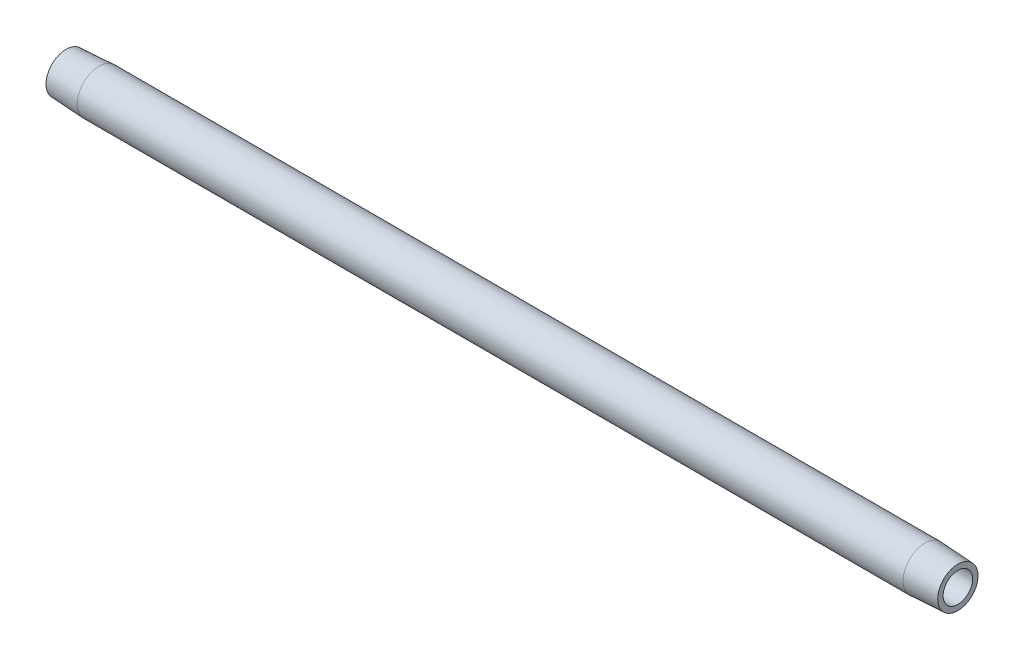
ISO-10303-21;
HEADER;
FILE_DESCRIPTION(('STEP AP214'),'2;1');
FILE_NAME('part.step','',(''),(''),'','','');
FILE_SCHEMA(('AUTOMOTIVE_DESIGN { 1 0 10303 214 1 1 1 1 }'));
ENDSEC;
DATA;
#1=APPLICATION_CONTEXT('core data for automotive mechanical design processes');
#2=APPLICATION_PROTOCOL_DEFINITION('international standard','automotive_design',2000,#1);
#3=PRODUCT_CONTEXT('',#1,'mechanical');
#4=PRODUCT('Part','Part','',(#3));
#5=PRODUCT_RELATED_PRODUCT_CATEGORY('part','',(#4));
#6=PRODUCT_DEFINITION_FORMATION('','',#4);
#7=PRODUCT_DEFINITION_CONTEXT('part definition',#1,'design');
#8=PRODUCT_DEFINITION('design','',#6,#7);
#9=PRODUCT_DEFINITION_SHAPE('','',#8);
#10=(LENGTH_UNIT() NAMED_UNIT(*) SI_UNIT(.MILLI.,.METRE.));
#11=(NAMED_UNIT(*) PLANE_ANGLE_UNIT() SI_UNIT($,.RADIAN.));
#12=(NAMED_UNIT(*) SI_UNIT($,.STERADIAN.) SOLID_ANGLE_UNIT());
#13=UNCERTAINTY_MEASURE_WITH_UNIT(LENGTH_MEASURE(1.E-05),#10,'distance_accuracy_value','');
#14=(GEOMETRIC_REPRESENTATION_CONTEXT(3) GLOBAL_UNCERTAINTY_ASSIGNED_CONTEXT((#13)) GLOBAL_UNIT_ASSIGNED_CONTEXT((#10,
#11,#12)) REPRESENTATION_CONTEXT('',''));
#15=CARTESIAN_POINT('',(0.,0.,0.));
#16=DIRECTION('',(0.,0.,1.));
#17=DIRECTION('',(1.,0.,0.));
#18=AXIS2_PLACEMENT_3D('',#15,#16,#17);
#19=CARTESIAN_POINT('',(279.4,0.,-4.62277681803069));
#20=DIRECTION('',(-1.,0.,0.));
#21=DIRECTION('',(0.,0.,1.));
#22=AXIS2_PLACEMENT_3D('',#19,#20,#21);
#23=PLANE('',#22);
#24=CARTESIAN_POINT('',(279.4,0.,0.));
#25=DIRECTION('',(-1.,0.,0.));
#26=DIRECTION('',(0.,0.,1.));
#27=AXIS2_PLACEMENT_3D('',#24,#25,#26);
#28=CIRCLE('',#27,6.31752683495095);
#29=CARTESIAN_POINT('',(279.4,0.,6.31752683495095));
#30=VERTEX_POINT('',#29);
#31=EDGE_CURVE('E10',#30,#30,#28,.T.);
#32=ORIENTED_EDGE('',*,*,#31,.F.);
#33=EDGE_LOOP('',(#32));
#34=FACE_BOUND('',#33,.T.);
#35=CARTESIAN_POINT('',(279.4,0.,0.));
#36=DIRECTION('',(-1.,0.,0.));
#37=DIRECTION('',(0.,0.,1.));
#38=AXIS2_PLACEMENT_3D('',#35,#36,#37);
#39=CIRCLE('',#38,4.62277681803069);
#40=CARTESIAN_POINT('',(279.4,0.,4.62277681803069));
#41=VERTEX_POINT('',#40);
#42=EDGE_CURVE('E52',#41,#41,#39,.T.);
#43=ORIENTED_EDGE('',*,*,#42,.T.);
#44=EDGE_LOOP('',(#43));
#45=FACE_BOUND('',#44,.T.);
#46=ADVANCED_FACE('F30',(#34,#45),#23,.F.);
#47=CARTESIAN_POINT('',(279.4,0.,0.));
#48=DIRECTION('',(-1.,0.,0.));
#49=DIRECTION('',(0.,0.,1.));
#50=AXIS2_PLACEMENT_3D('',#47,#48,#49);
#51=CONICAL_SURFACE('',#50,6.31752683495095,0.052359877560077);
#52=CARTESIAN_POINT('',(269.087600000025,0.,0.));
#53=DIRECTION('',(-1.,0.,0.));
#54=DIRECTION('',(0.,0.,1.));
#55=AXIS2_PLACEMENT_3D('',#52,#53,#54);
#56=CIRCLE('',#55,6.85797681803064);
#57=CARTESIAN_POINT('',(269.087600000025,0.,6.85797681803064));
#58=VERTEX_POINT('',#57);
#59=EDGE_CURVE('E36',#58,#58,#56,.T.);
#60=ORIENTED_EDGE('',*,*,#59,.F.);
#61=EDGE_LOOP('',(#60));
#62=FACE_BOUND('',#61,.T.);
#63=ORIENTED_EDGE('',*,*,#31,.T.);
#64=EDGE_LOOP('',(#63));
#65=FACE_BOUND('',#64,.T.);
#66=ADVANCED_FACE('F77',(#62,#65),#51,.T.);
#67=CARTESIAN_POINT('',(-6.37599469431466,0.,0.));
#68=DIRECTION('',(-1.,0.,0.));
#69=DIRECTION('',(0.,0.,1.));
#70=AXIS2_PLACEMENT_3D('',#67,#68,#69);
#71=CYLINDRICAL_SURFACE('',#70,6.85797681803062);
#72=CARTESIAN_POINT('',(10.3123999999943,0.,0.));
#73=DIRECTION('',(-1.,0.,0.));
#74=DIRECTION('',(0.,0.,1.));
#75=AXIS2_PLACEMENT_3D('',#72,#73,#74);
#76=CIRCLE('',#75,6.8579768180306);
#77=CARTESIAN_POINT('',(10.3123999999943,0.,6.8579768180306));
#78=VERTEX_POINT('',#77);
#79=EDGE_CURVE('E40',#78,#78,#76,.T.);
#80=ORIENTED_EDGE('',*,*,#79,.F.);
#81=EDGE_LOOP('',(#80));
#82=FACE_BOUND('',#81,.T.);
#83=ORIENTED_EDGE('',*,*,#59,.T.);
#84=EDGE_LOOP('',(#83));
#85=FACE_BOUND('',#84,.T.);
#86=ADVANCED_FACE('F72',(#82,#85),#71,.T.);
#87=CARTESIAN_POINT('',(10.3123999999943,0.,0.));
#88=DIRECTION('',(1.,0.,0.));
#89=DIRECTION('',(0.,0.,-1.));
#90=AXIS2_PLACEMENT_3D('',#87,#88,#89);
#91=CONICAL_SURFACE('',#90,6.8579768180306,0.0523598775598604);
#92=CARTESIAN_POINT('',(1.90819582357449E-11,0.,0.));
#93=DIRECTION('',(-1.,0.,0.));
#94=DIRECTION('',(0.,0.,1.));
#95=AXIS2_PLACEMENT_3D('',#92,#93,#94);
#96=CIRCLE('',#95,6.31752683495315);
#97=CARTESIAN_POINT('',(1.90819582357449E-11,0.,6.31752683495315));
#98=VERTEX_POINT('',#97);
#99=EDGE_CURVE('E44',#98,#98,#96,.T.);
#100=ORIENTED_EDGE('',*,*,#99,.F.);
#101=EDGE_LOOP('',(#100));
#102=FACE_BOUND('',#101,.T.);
#103=ORIENTED_EDGE('',*,*,#79,.T.);
#104=EDGE_LOOP('',(#103));
#105=FACE_BOUND('',#104,.T.);
#106=ADVANCED_FACE('F66',(#102,#105),#91,.T.);
#107=CARTESIAN_POINT('',(1.90819582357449E-11,0.,-6.31752683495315));
#108=DIRECTION('',(1.,0.,0.));
#109=DIRECTION('',(0.,0.,-1.));
#110=AXIS2_PLACEMENT_3D('',#107,#108,#109);
#111=PLANE('',#110);
#112=CARTESIAN_POINT('',(1.90819582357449E-11,0.,0.));
#113=DIRECTION('',(-1.,0.,0.));
#114=DIRECTION('',(0.,0.,1.));
#115=AXIS2_PLACEMENT_3D('',#112,#113,#114);
#116=CIRCLE('',#115,4.62277681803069);
#117=CARTESIAN_POINT('',(1.90819582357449E-11,0.,4.62277681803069));
#118=VERTEX_POINT('',#117);
#119=EDGE_CURVE('E49',#118,#118,#116,.T.);
#120=ORIENTED_EDGE('',*,*,#119,.F.);
#121=EDGE_LOOP('',(#120));
#122=FACE_BOUND('',#121,.T.);
#123=ORIENTED_EDGE('',*,*,#99,.T.);
#124=EDGE_LOOP('',(#123));
#125=FACE_BOUND('',#124,.T.);
#126=ADVANCED_FACE('F60',(#122,#125),#111,.F.);
#127=CARTESIAN_POINT('',(-6.37599469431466,0.,0.));
#128=DIRECTION('',(-1.,0.,0.));
#129=DIRECTION('',(0.,0.,1.));
#130=AXIS2_PLACEMENT_3D('',#127,#128,#129);
#131=CYLINDRICAL_SURFACE('',#130,4.62277681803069);
#132=ORIENTED_EDGE('',*,*,#42,.F.);
#133=EDGE_LOOP('',(#132));
#134=FACE_BOUND('',#133,.T.);
#135=ORIENTED_EDGE('',*,*,#119,.T.);
#136=EDGE_LOOP('',(#135));
#137=FACE_BOUND('',#136,.T.);
#138=ADVANCED_FACE('F57',(#134,#137),#131,.F.);
#139=CLOSED_SHELL('',(#46,#66,#86,#106,#126,#138));
#140=MANIFOLD_SOLID_BREP('B2',#139);
#141=ADVANCED_BREP_SHAPE_REPRESENTATION('',(#18,#140),#14);
#142=SHAPE_DEFINITION_REPRESENTATION(#9,#141);
ENDSEC;
END-ISO-10303-21;
